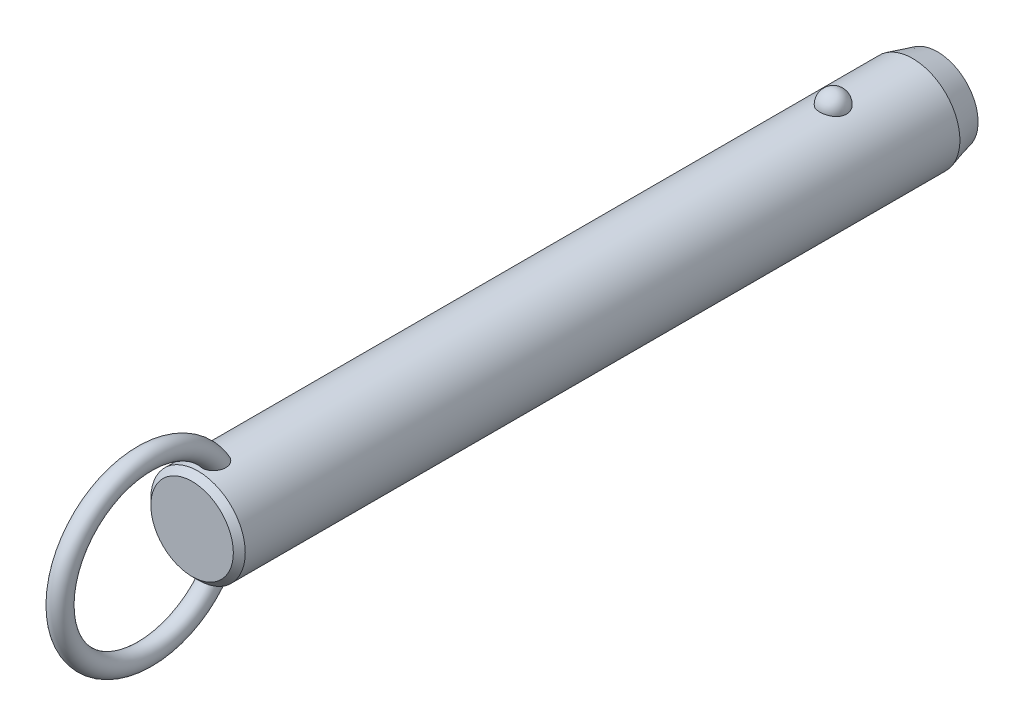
ISO-10303-21;
HEADER;
FILE_DESCRIPTION(('STEP AP214'),'2;1');
FILE_NAME('part.step','',(''),(''),'','','');
FILE_SCHEMA(('AUTOMOTIVE_DESIGN { 1 0 10303 214 1 1 1 1 }'));
ENDSEC;
DATA;
#1=APPLICATION_CONTEXT('core data for automotive mechanical design processes');
#2=APPLICATION_PROTOCOL_DEFINITION('international standard','automotive_design',2000,#1);
#3=PRODUCT_CONTEXT('',#1,'mechanical');
#4=PRODUCT('Part','Part','',(#3));
#5=PRODUCT_RELATED_PRODUCT_CATEGORY('part','',(#4));
#6=PRODUCT_DEFINITION_FORMATION('','',#4);
#7=PRODUCT_DEFINITION_CONTEXT('part definition',#1,'design');
#8=PRODUCT_DEFINITION('design','',#6,#7);
#9=PRODUCT_DEFINITION_SHAPE('','',#8);
#10=(LENGTH_UNIT() NAMED_UNIT(*) SI_UNIT(.MILLI.,.METRE.));
#11=(NAMED_UNIT(*) PLANE_ANGLE_UNIT() SI_UNIT($,.RADIAN.));
#12=(NAMED_UNIT(*) SI_UNIT($,.STERADIAN.) SOLID_ANGLE_UNIT());
#13=UNCERTAINTY_MEASURE_WITH_UNIT(LENGTH_MEASURE(1.E-05),#10,'distance_accuracy_value','');
#14=(GEOMETRIC_REPRESENTATION_CONTEXT(3) GLOBAL_UNCERTAINTY_ASSIGNED_CONTEXT((#13)) GLOBAL_UNIT_ASSIGNED_CONTEXT((#10,
#11,#12)) REPRESENTATION_CONTEXT('',''));
#15=CARTESIAN_POINT('',(0.,0.,0.));
#16=DIRECTION('',(0.,0.,1.));
#17=DIRECTION('',(1.,0.,0.));
#18=AXIS2_PLACEMENT_3D('',#15,#16,#17);
#19=CARTESIAN_POINT('',(0.,0.,116.8));
#20=DIRECTION('',(0.,0.,-1.));
#21=DIRECTION('',(-1.,0.,0.));
#22=AXIS2_PLACEMENT_3D('',#19,#20,#21);
#23=CYLINDRICAL_SURFACE('',#22,9.5);
#24=CARTESIAN_POINT('',(2.67259918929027,9.11631578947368,-2.70000000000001));
#25=CARTESIAN_POINT('',(2.6725968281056,9.11631786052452,-2.54909854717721));
#26=CARTESIAN_POINT('',(2.66030567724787,9.11994722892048,-2.39816735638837));
#27=CARTESIAN_POINT('',(2.6114347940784,9.13405924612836,-2.10058568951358));
#28=CARTESIAN_POINT('',(2.57484658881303,9.14454428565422,-1.95393672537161));
#29=CARTESIAN_POINT('',(2.47830875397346,9.17117631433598,-1.66916069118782));
#30=CARTESIAN_POINT('',(2.41836936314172,9.18732082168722,-1.53102991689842));
#31=CARTESIAN_POINT('',(2.27661331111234,9.22346780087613,-1.26705393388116));
#32=CARTESIAN_POINT('',(2.19479699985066,9.24347021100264,-1.14120852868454));
#33=CARTESIAN_POINT('',(2.01085282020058,9.28522401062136,-0.904632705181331));
#34=CARTESIAN_POINT('',(1.90862396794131,9.30698376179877,-0.793982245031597));
#35=CARTESIAN_POINT('',(1.6867437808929,9.34973971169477,-0.591607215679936));
#36=CARTESIAN_POINT('',(1.56709244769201,9.37073591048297,-0.499882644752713));
#37=CARTESIAN_POINT('',(1.31393976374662,9.40956370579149,-0.338167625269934));
#38=CARTESIAN_POINT('',(1.18048026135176,9.42740444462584,-0.268113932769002));
#39=CARTESIAN_POINT('',(0.903154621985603,9.45799906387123,-0.151390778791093));
#40=CARTESIAN_POINT('',(0.759289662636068,9.47075351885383,-0.104718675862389));
#41=CARTESIAN_POINT('',(0.468074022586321,9.48956256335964,-0.0367633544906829));
#42=CARTESIAN_POINT('',(0.320836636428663,9.49573643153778,-0.0150275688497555));
#43=CARTESIAN_POINT('',(0.0246714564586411,9.50112183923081,0.00396199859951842));
#44=CARTESIAN_POINT('',(-0.124256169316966,9.50033406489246,0.00121819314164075));
#45=CARTESIAN_POINT('',(-0.417264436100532,9.4919475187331,-0.0284441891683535));
#46=CARTESIAN_POINT('',(-0.56138413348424,9.48444885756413,-0.0550074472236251));
#47=CARTESIAN_POINT('',(-0.842986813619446,9.46357853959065,-0.131064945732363));
#48=CARTESIAN_POINT('',(-0.980469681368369,9.450206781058,-0.180559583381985));
#49=CARTESIAN_POINT('',(-1.24585005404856,9.41890822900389,-0.301476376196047));
#50=CARTESIAN_POINT('',(-1.37368611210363,9.40095498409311,-0.373026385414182));
#51=CARTESIAN_POINT('',(-1.61552738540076,9.36242964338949,-0.536025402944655));
#52=CARTESIAN_POINT('',(-1.72953116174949,9.34185727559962,-0.627476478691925));
#53=CARTESIAN_POINT('',(-1.9429225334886,9.29984568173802,-0.829844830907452));
#54=CARTESIAN_POINT('',(-2.04198021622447,9.27839736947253,-0.94110821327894));
#55=CARTESIAN_POINT('',(-2.22026460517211,9.23735994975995,-1.17883414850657));
#56=CARTESIAN_POINT('',(-2.29948985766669,9.21777097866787,-1.30529781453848));
#57=CARTESIAN_POINT('',(-2.43697287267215,9.18238994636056,-1.57158566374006));
#58=CARTESIAN_POINT('',(-2.49497068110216,9.16664569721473,-1.71155057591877));
#59=CARTESIAN_POINT('',(-2.5872073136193,9.14104303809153,-1.99961197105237));
#60=CARTESIAN_POINT('',(-2.62144683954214,9.13118445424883,-2.14770821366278));
#61=CARTESIAN_POINT('',(-2.66521466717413,9.11850622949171,-2.44715424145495));
#62=CARTESIAN_POINT('',(-2.67484831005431,9.11565658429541,-2.59848735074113));
#63=CARTESIAN_POINT('',(-2.66946735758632,9.11723375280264,-2.90067317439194));
#64=CARTESIAN_POINT('',(-2.65445345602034,9.12166036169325,-3.05152590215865));
#65=CARTESIAN_POINT('',(-2.60029711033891,9.13724422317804,-3.34766110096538));
#66=CARTESIAN_POINT('',(-2.56127978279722,9.14836656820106,-3.49296833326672));
#67=CARTESIAN_POINT('',(-2.46018844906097,9.17606676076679,-3.77477535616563));
#68=CARTESIAN_POINT('',(-2.39811349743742,9.1926448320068,-3.9112747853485));
#69=CARTESIAN_POINT('',(-2.25202303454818,9.22952198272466,-4.17244273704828));
#70=CARTESIAN_POINT('',(-2.16788714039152,9.24984129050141,-4.29704106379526));
#71=CARTESIAN_POINT('',(-1.9799408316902,9.29188255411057,-4.53013066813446));
#72=CARTESIAN_POINT('',(-1.87612963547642,9.31360456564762,-4.63862130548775));
#73=CARTESIAN_POINT('',(-1.65105429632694,9.35612959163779,-4.8369029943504));
#74=CARTESIAN_POINT('',(-1.52972405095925,9.37692871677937,-4.92661991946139));
#75=CARTESIAN_POINT('',(-1.27318250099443,9.41518970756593,-5.08429106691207));
#76=CARTESIAN_POINT('',(-1.13797219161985,9.432651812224,-5.15224684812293));
#77=CARTESIAN_POINT('',(-0.859280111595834,9.46208255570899,-5.26371827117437));
#78=CARTESIAN_POINT('',(-0.715925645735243,9.47411833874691,-5.30753421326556));
#79=CARTESIAN_POINT('',(-0.423550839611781,9.4916822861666,-5.37076321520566));
#80=CARTESIAN_POINT('',(-0.2745312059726,9.49721125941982,-5.39017930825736));
#81=CARTESIAN_POINT('',(0.0218446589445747,9.50110860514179,-5.40390587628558));
#82=CARTESIAN_POINT('',(0.16917707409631,9.49961381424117,-5.39869609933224));
#83=CARTESIAN_POINT('',(0.460808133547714,9.48993906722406,-5.36441955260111));
#84=CARTESIAN_POINT('',(0.605106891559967,9.48175936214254,-5.33535367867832));
#85=CARTESIAN_POINT('',(0.886027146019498,9.4596376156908,-5.25435587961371));
#86=CARTESIAN_POINT('',(1.02267710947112,9.44571881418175,-5.20251612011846));
#87=CARTESIAN_POINT('',(1.28523827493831,9.41358993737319,-5.07741549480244));
#88=CARTESIAN_POINT('',(1.41114877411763,9.39537958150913,-5.00415322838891));
#89=CARTESIAN_POINT('',(1.65085227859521,9.3562644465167,-4.83684599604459));
#90=CARTESIAN_POINT('',(1.76442346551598,9.33532178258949,-4.74249218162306));
#91=CARTESIAN_POINT('',(1.97425672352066,9.29321198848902,-4.53620389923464));
#92=CARTESIAN_POINT('',(2.07051582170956,9.27204482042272,-4.42426641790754));
#93=CARTESIAN_POINT('',(2.24490086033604,9.23139221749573,-4.18363183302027));
#94=CARTESIAN_POINT('',(2.32267019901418,9.21194380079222,-4.05466990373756));
#95=CARTESIAN_POINT('',(2.45584092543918,9.1773419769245,-3.78517836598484));
#96=CARTESIAN_POINT('',(2.5112497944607,9.16218713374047,-3.64465264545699));
#97=CARTESIAN_POINT('',(2.59380876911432,9.13913522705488,-3.37104301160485));
#98=CARTESIAN_POINT('',(2.62330266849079,9.13064624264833,-3.23871053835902));
#99=CARTESIAN_POINT('',(2.66269870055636,9.11923566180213,-2.97092664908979));
#100=CARTESIAN_POINT('',(2.67260130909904,9.11631393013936,-2.83547530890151));
#101=CARTESIAN_POINT('',(2.67259918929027,9.11631578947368,-2.70000000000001));
#102=B_SPLINE_CURVE_WITH_KNOTS('',3,(#24,#25,#26,#27,#28,#29,#30,#31,#32,#33,#34,#35,#36,#37,
#38,#39,#40,#41,#42,#43,#44,#45,#46,#47,#48,#49,#50,#51,#52,#53,#54,#55,#56,#57,#58,#59,#60,#61,
#62,#63,#64,#65,#66,#67,#68,#69,#70,#71,#72,#73,#74,#75,#76,#77,#78,#79,#80,#81,#82,#83,#84,#85,
#86,#87,#88,#89,#90,#91,#92,#93,#94,#95,#96,#97,#98,#99,#100,#101),.UNSPECIFIED.,.T.,.F.,(4,2,2,
2,2,2,2,2,2,2,2,2,2,2,2,2,2,2,2,2,2,2,2,2,2,2,2,2,2,2,2,2,2,2,2,2,2,2,4),(0.,0.452217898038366,
0.904593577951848,1.35677112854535,1.80894144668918,2.26340676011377,2.71787203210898,
3.17099820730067,3.62407318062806,4.0687883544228,4.51345969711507,4.95160616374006,
5.38976021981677,5.83050358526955,6.27129275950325,6.72071308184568,7.17016633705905,
7.62495278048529,8.07972578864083,8.53254856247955,8.98535859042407,9.43582813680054,
9.88631615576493,10.3393155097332,10.7923328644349,11.2471065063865,11.7018475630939,
12.150795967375,12.599688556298,13.0398725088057,13.4800399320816,13.9184421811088,
14.3568730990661,14.802202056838,15.2476074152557,15.7010097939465,16.1542603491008,
16.5602594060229,16.966248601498),.UNSPECIFIED.);
#103=CARTESIAN_POINT('',(2.67259918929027,9.11631578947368,-2.70000000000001));
#104=VERTEX_POINT('',#103);
#105=EDGE_CURVE('E41',#104,#104,#102,.T.);
#106=ORIENTED_EDGE('',*,*,#105,.T.);
#107=EDGE_LOOP('',(#106));
#108=FACE_BOUND('',#107,.T.);
#109=CARTESIAN_POINT('',(0.,0.,125.12));
#110=DIRECTION('',(0.,0.,1.));
#111=DIRECTION('',(1.,0.,0.));
#112=AXIS2_PLACEMENT_3D('',#109,#110,#111);
#113=CIRCLE('',#112,9.5);
#114=CARTESIAN_POINT('',(9.5,0.,125.12));
#115=VERTEX_POINT('',#114);
#116=EDGE_CURVE('E10',#115,#115,#113,.F.);
#117=ORIENTED_EDGE('',*,*,#116,.T.);
#118=EDGE_LOOP('',(#117));
#119=FACE_BOUND('',#118,.T.);
#120=CARTESIAN_POINT('',(-0.697062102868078,-9.47439269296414,119.467808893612));
#121=CARTESIAN_POINT('',(-0.799579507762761,-9.46685146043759,119.507482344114));
#122=CARTESIAN_POINT('',(-0.898575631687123,-9.45788043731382,119.5559309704));
#123=CARTESIAN_POINT('',(-1.08670047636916,-9.43811593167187,119.668868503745));
#124=CARTESIAN_POINT('',(-1.17583204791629,-9.42732297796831,119.733352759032));
#125=CARTESIAN_POINT('',(-1.34179806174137,-9.40513672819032,119.876209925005));
#126=CARTESIAN_POINT('',(-1.41865133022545,-9.39374438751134,119.954561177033));
#127=CARTESIAN_POINT('',(-1.55860047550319,-9.37154196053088,120.122752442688));
#128=CARTESIAN_POINT('',(-1.62169476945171,-9.3607319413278,120.21259377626));
#129=CARTESIAN_POINT('',(-1.73527695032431,-9.34035749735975,120.404500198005));
#130=CARTESIAN_POINT('',(-1.78522266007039,-9.33085270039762,120.506891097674));
#131=CARTESIAN_POINT('',(-1.86924997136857,-9.3143834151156,120.718148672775));
#132=CARTESIAN_POINT('',(-1.90332570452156,-9.30741986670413,120.827017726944));
#133=CARTESIAN_POINT('',(-1.95893603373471,-9.29588482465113,121.060473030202));
#134=CARTESIAN_POINT('',(-1.97872420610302,-9.29165182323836,121.185489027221));
#135=CARTESIAN_POINT('',(-2.00062129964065,-9.28695978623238,121.437080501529));
#136=CARTESIAN_POINT('',(-2.00272284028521,-9.28650232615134,121.563656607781));
#137=CARTESIAN_POINT('',(-1.98958876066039,-9.28932750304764,121.836815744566));
#138=CARTESIAN_POINT('',(-1.97143366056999,-9.2932400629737,121.983251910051));
#139=CARTESIAN_POINT('',(-1.91479925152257,-9.30507151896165,122.272062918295));
#140=CARTESIAN_POINT('',(-1.87629122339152,-9.31299607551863,122.414431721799));
#141=CARTESIAN_POINT('',(-1.7722568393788,-9.33340232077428,122.715172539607));
#142=CARTESIAN_POINT('',(-1.70334898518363,-9.34641636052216,122.872369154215));
#143=CARTESIAN_POINT('',(-1.58111062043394,-9.36759153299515,123.097517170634));
#144=CARTESIAN_POINT('',(-1.53721459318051,-9.37492619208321,123.170796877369));
#145=CARTESIAN_POINT('',(-1.4430263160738,-9.38988566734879,123.31307405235));
#146=CARTESIAN_POINT('',(-1.39273721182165,-9.39751033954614,123.382073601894));
#147=CARTESIAN_POINT('',(-1.26775962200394,-9.41530678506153,123.536983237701));
#148=CARTESIAN_POINT('',(-1.19052326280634,-9.42548108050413,123.620871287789));
#149=CARTESIAN_POINT('',(-1.0242024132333,-9.44499825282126,123.776008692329));
#150=CARTESIAN_POINT('',(-0.935139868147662,-9.45434261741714,123.847280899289));
#151=CARTESIAN_POINT('',(-0.766610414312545,-9.46930670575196,123.958695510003));
#152=CARTESIAN_POINT('',(-0.689439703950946,-9.47529223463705,124.002235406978));
#153=CARTESIAN_POINT('',(-0.528942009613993,-9.48560294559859,124.07631336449));
#154=CARTESIAN_POINT('',(-0.445620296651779,-9.48992953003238,124.106862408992));
#155=CARTESIAN_POINT('',(-0.273901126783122,-9.49644161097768,124.152579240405));
#156=CARTESIAN_POINT('',(-0.185465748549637,-9.49860811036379,124.16761059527));
#157=CARTESIAN_POINT('',(-0.00734541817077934,-9.5004135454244,124.180149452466));
#158=CARTESIAN_POINT('',(0.0823387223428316,-9.50005405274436,124.177667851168));
#159=CARTESIAN_POINT('',(0.247679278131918,-9.49708301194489,124.156995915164));
#160=CARTESIAN_POINT('',(0.32362017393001,-9.49477609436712,124.140930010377));
#161=CARTESIAN_POINT('',(0.47198153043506,-9.48855917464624,124.097172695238));
#162=CARTESIAN_POINT('',(0.54440029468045,-9.48464840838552,124.069475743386));
#163=CARTESIAN_POINT('',(0.708947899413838,-9.47398336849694,123.99280266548));
#164=CARTESIAN_POINT('',(0.799149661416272,-9.46671310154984,123.939774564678));
#165=CARTESIAN_POINT('',(0.969783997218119,-9.45076225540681,123.819973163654));
#166=CARTESIAN_POINT('',(1.05019415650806,-9.44207854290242,123.753169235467));
#167=CARTESIAN_POINT('',(1.23092343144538,-9.42051459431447,123.580759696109));
#168=CARTESIAN_POINT('',(1.32652499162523,-9.40733378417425,123.47026193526));
#169=CARTESIAN_POINT('',(1.49893121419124,-9.3814074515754,123.235561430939));
#170=CARTESIAN_POINT('',(1.57571616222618,-9.36866239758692,123.111344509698));
#171=CARTESIAN_POINT('',(1.71285426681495,-9.34457644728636,122.849389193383));
#172=CARTESIAN_POINT('',(1.7726636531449,-9.33328726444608,122.71136233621));
#173=CARTESIAN_POINT('',(1.87239208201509,-9.31379209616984,122.428051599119));
#174=CARTESIAN_POINT('',(1.91230158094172,-9.3055875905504,122.282764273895));
#175=CARTESIAN_POINT('',(1.97604189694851,-9.29228394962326,121.962028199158));
#176=CARTESIAN_POINT('',(1.99587438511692,-9.28797202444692,121.785724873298));
#177=CARTESIAN_POINT('',(2.0029570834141,-9.28645519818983,121.432414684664));
#178=CARTESIAN_POINT('',(1.99025930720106,-9.28923895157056,121.255409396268));
#179=CARTESIAN_POINT('',(1.93735479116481,-9.30038134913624,120.956338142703));
#180=CARTESIAN_POINT('',(1.90576827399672,-9.30697680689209,120.832667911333));
#181=CARTESIAN_POINT('',(1.82287484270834,-9.32356855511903,120.592329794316));
#182=CARTESIAN_POINT('',(1.77158213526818,-9.33356239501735,120.475656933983));
#183=CARTESIAN_POINT('',(1.64885744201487,-9.35602275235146,120.252706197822));
#184=CARTESIAN_POINT('',(1.57730995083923,-9.36850332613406,120.146492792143));
#185=CARTESIAN_POINT('',(1.41543264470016,-9.39431873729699,119.949553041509));
#186=CARTESIAN_POINT('',(1.3251088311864,-9.40765330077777,119.858821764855));
#187=CARTESIAN_POINT('',(1.13846223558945,-9.43195720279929,119.705033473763));
#188=CARTESIAN_POINT('',(1.04369890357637,-9.44302894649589,119.640094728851));
#189=CARTESIAN_POINT('',(0.84396568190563,-9.46296805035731,119.528038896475));
#190=CARTESIAN_POINT('',(0.73900000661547,-9.4718363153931,119.480914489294));
#191=CARTESIAN_POINT('',(0.528175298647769,-9.48586140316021,119.408117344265));
#192=CARTESIAN_POINT('',(0.422686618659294,-9.49119633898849,119.38140249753));
#193=CARTESIAN_POINT('',(0.208590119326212,-9.49831365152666,119.346013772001));
#194=CARTESIAN_POINT('',(0.0999817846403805,-9.500095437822,119.337342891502));
#195=CARTESIAN_POINT('',(-0.126104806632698,-9.49988861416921,119.338350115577));
#196=CARTESIAN_POINT('',(-0.243578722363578,-9.49757821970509,119.349594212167));
#197=CARTESIAN_POINT('',(-0.474390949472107,-9.48885165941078,119.393167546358));
#198=CARTESIAN_POINT('',(-0.587729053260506,-9.48243528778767,119.425497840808));
#199=CARTESIAN_POINT('',(-0.697062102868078,-9.47439269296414,119.467808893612));
#200=B_SPLINE_CURVE_WITH_KNOTS('',3,(#120,#121,#122,#123,#124,#125,#126,#127,#128,#129,#130,
#131,#132,#133,#134,#135,#136,#137,#138,#139,#140,#141,#142,#143,#144,#145,#146,#147,#148,#149,
#150,#151,#152,#153,#154,#155,#156,#157,#158,#159,#160,#161,#162,#163,#164,#165,#166,#167,#168,
#169,#170,#171,#172,#173,#174,#175,#176,#177,#178,#179,#180,#181,#182,#183,#184,#185,#186,#187,
#188,#189,#190,#191,#192,#193,#194,#195,#196,#197,#198,#199),.UNSPECIFIED.,.T.,.F.,(4,2,2,2,2,2,
2,2,2,2,2,2,2,2,2,2,2,2,2,2,2,2,2,2,2,2,2,2,2,2,2,2,2,2,2,2,2,2,2,4),(0.,0.330119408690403,
0.660143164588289,0.98965593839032,1.31920659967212,1.66074728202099,2.00241415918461,
2.3808869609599,2.7595176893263,3.20065679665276,3.64242004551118,4.15620996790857,
4.41314162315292,4.66994734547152,5.0122866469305,5.35399933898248,5.61943037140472,
5.88463652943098,6.15215502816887,6.41950709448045,6.6514439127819,6.88349136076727,
7.19641200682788,7.51003602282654,7.94779711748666,8.38601491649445,8.83699707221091,
9.28819530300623,9.81778662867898,10.3465317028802,10.7284172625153,11.1100280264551,
11.4938603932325,11.8775702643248,12.2220189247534,12.5663259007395,12.8915939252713,
13.2169159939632,13.5689650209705,13.9210316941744),.UNSPECIFIED.);
#201=CARTESIAN_POINT('',(-0.697062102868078,-9.47439269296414,119.467808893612));
#202=VERTEX_POINT('',#201);
#203=EDGE_CURVE('E60',#202,#202,#200,.T.);
#204=ORIENTED_EDGE('',*,*,#203,.T.);
#205=EDGE_LOOP('',(#204));
#206=FACE_BOUND('',#205,.T.);
#207=CARTESIAN_POINT('',(-0.697062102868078,9.47439269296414,119.467808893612));
#208=CARTESIAN_POINT('',(-0.597792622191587,9.48169483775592,119.42939564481));
#209=CARTESIAN_POINT('',(-0.495106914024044,9.48766580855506,119.399168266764));
#210=CARTESIAN_POINT('',(-0.285876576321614,9.49627648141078,119.356032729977));
#211=CARTESIAN_POINT('',(-0.179324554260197,9.49890941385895,119.343159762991));
#212=CARTESIAN_POINT('',(0.0344157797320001,9.50053798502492,119.335166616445));
#213=CARTESIAN_POINT('',(0.141603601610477,9.49953613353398,119.340034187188));
#214=CARTESIAN_POINT('',(0.353563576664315,9.49401038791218,119.367365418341));
#215=CARTESIAN_POINT('',(0.458336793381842,9.48948807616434,119.38982117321));
#216=CARTESIAN_POINT('',(0.66249373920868,9.4774236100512,119.451671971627));
#217=CARTESIAN_POINT('',(0.761881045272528,9.46988348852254,119.491055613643));
#218=CARTESIAN_POINT('',(0.952608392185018,9.45260382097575,119.585634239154));
#219=CARTESIAN_POINT('',(1.04394806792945,9.44286417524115,119.640829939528));
#220=CARTESIAN_POINT('',(1.21712767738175,9.4221176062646,119.766066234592));
#221=CARTESIAN_POINT('',(1.29885671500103,9.41109835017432,119.836257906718));
#222=CARTESIAN_POINT('',(1.4497897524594,9.38903310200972,119.988980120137));
#223=CARTESIAN_POINT('',(1.51899278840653,9.37798710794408,120.071511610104));
#224=CARTESIAN_POINT('',(1.64602857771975,9.35654375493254,120.249776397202));
#225=CARTESIAN_POINT('',(1.70333052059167,9.34618688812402,120.345891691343));
#226=CARTESIAN_POINT('',(1.80259341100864,9.32755128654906,120.545897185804));
#227=CARTESIAN_POINT('',(1.84454942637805,9.31927322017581,120.649789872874));
#228=CARTESIAN_POINT('',(1.91637039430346,9.30478365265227,120.872213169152));
#229=CARTESIAN_POINT('',(1.944805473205,9.29882552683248,120.991219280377));
#230=CARTESIAN_POINT('',(1.98449865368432,9.29043398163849,121.232143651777));
#231=CARTESIAN_POINT('',(1.99574908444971,9.28800213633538,121.354063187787));
#232=CARTESIAN_POINT('',(2.00275141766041,9.28649645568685,121.616932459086));
#233=CARTESIAN_POINT('',(1.99588238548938,9.28799035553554,121.757952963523));
#234=CARTESIAN_POINT('',(1.96270559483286,9.29505517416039,122.037621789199));
#235=CARTESIAN_POINT('',(1.93637872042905,9.30063010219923,122.176267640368));
#236=CARTESIAN_POINT('',(1.85949176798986,9.31633564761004,122.472561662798));
#237=CARTESIAN_POINT('',(1.80549792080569,9.3270926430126,122.629290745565));
#238=CARTESIAN_POINT('',(1.67376869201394,9.3516306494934,122.932284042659));
#239=CARTESIAN_POINT('',(1.5960318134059,9.36541185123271,123.078547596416));
#240=CARTESIAN_POINT('',(1.4360277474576,9.39110706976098,123.325813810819));
#241=CARTESIAN_POINT('',(1.35831795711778,9.40278656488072,123.429791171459));
#242=CARTESIAN_POINT('',(1.18774483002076,9.42585025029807,123.624534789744));
#243=CARTESIAN_POINT('',(1.09490932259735,9.43723493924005,123.715324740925));
#244=CARTESIAN_POINT('',(0.921110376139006,9.45552616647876,123.85620334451));
#245=CARTESIAN_POINT('',(0.843738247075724,9.46281058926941,123.910656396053));
#246=CARTESIAN_POINT('',(0.681245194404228,9.47589120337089,124.006711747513));
#247=CARTESIAN_POINT('',(0.596135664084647,9.48168953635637,124.048332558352));
#248=CARTESIAN_POINT('',(0.433779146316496,9.49038144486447,124.110089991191));
#249=CARTESIAN_POINT('',(0.35745955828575,9.49359170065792,124.13260136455));
#250=CARTESIAN_POINT('',(0.202074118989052,9.49816761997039,124.164574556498));
#251=CARTESIAN_POINT('',(0.123010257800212,9.49953459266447,124.174045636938));
#252=CARTESIAN_POINT('',(-0.035737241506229,9.50026497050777,124.179114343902));
#253=CARTESIAN_POINT('',(-0.115421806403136,9.49962433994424,124.174684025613));
#254=CARTESIAN_POINT('',(-0.272823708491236,9.49640854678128,124.152296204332));
#255=CARTESIAN_POINT('',(-0.350540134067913,9.4938325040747,124.134332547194));
#256=CARTESIAN_POINT('',(-0.500580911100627,9.4870946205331,124.086802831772));
#257=CARTESIAN_POINT('',(-0.572979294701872,9.48296359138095,124.057461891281));
#258=CARTESIAN_POINT('',(-0.712864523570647,9.47347609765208,123.989008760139));
#259=CARTESIAN_POINT('',(-0.780349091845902,9.46811906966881,123.949892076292));
#260=CARTESIAN_POINT('',(-0.946309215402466,9.45329720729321,123.839432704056));
#261=CARTESIAN_POINT('',(-1.04090230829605,9.44321512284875,123.762329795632));
#262=CARTESIAN_POINT('',(-1.21661929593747,9.42219227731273,123.59409718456));
#263=CARTESIAN_POINT('',(-1.29770519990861,9.41124921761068,123.502929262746));
#264=CARTESIAN_POINT('',(-1.4731964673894,9.38563439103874,123.276162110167));
#265=CARTESIAN_POINT('',(-1.56208878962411,9.37102009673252,123.136289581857));
#266=CARTESIAN_POINT('',(-1.71623987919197,9.34401559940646,122.843950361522));
#267=CARTESIAN_POINT('',(-1.78147866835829,9.33162728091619,122.691473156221));
#268=CARTESIAN_POINT('',(-1.88853837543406,9.31055541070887,122.375647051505));
#269=CARTESIAN_POINT('',(-1.92998995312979,9.30193076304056,122.212168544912));
#270=CARTESIAN_POINT('',(-1.98590726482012,9.29015757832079,121.880526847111));
#271=CARTESIAN_POINT('',(-2.00040705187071,9.2870021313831,121.712369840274));
#272=CARTESIAN_POINT('',(-1.99964701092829,9.28716218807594,121.405080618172));
#273=CARTESIAN_POINT('',(-1.98908145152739,9.28945704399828,121.265936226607));
#274=CARTESIAN_POINT('',(-1.94566294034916,9.29865169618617,120.991153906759));
#275=CARTESIAN_POINT('',(-1.91282062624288,9.30554929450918,120.855514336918));
#276=CARTESIAN_POINT('',(-1.84582133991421,9.31898248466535,120.657802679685));
#277=CARTESIAN_POINT('',(-1.82038084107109,9.32400364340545,120.592583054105));
#278=CARTESIAN_POINT('',(-1.76350511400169,9.33492884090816,120.464903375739));
#279=CARTESIAN_POINT('',(-1.73207305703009,9.3408324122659,120.402441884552));
#280=CARTESIAN_POINT('',(-1.66324243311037,9.353333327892,120.28094078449));
#281=CARTESIAN_POINT('',(-1.62584239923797,9.35993084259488,120.221902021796));
#282=CARTESIAN_POINT('',(-1.545276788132,9.37356864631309,120.107987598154));
#283=CARTESIAN_POINT('',(-1.50211241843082,9.38060884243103,120.053111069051));
#284=CARTESIAN_POINT('',(-1.37681147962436,9.40004442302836,119.909961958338));
#285=CARTESIAN_POINT('',(-1.28916358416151,9.41261047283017,119.826429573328));
#286=CARTESIAN_POINT('',(-1.09996826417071,9.43658180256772,119.677236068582));
#287=CARTESIAN_POINT('',(-0.998461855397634,9.44799034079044,119.611523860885));
#288=CARTESIAN_POINT('',(-0.860188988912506,9.46103017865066,119.5394367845));
#289=CARTESIAN_POINT('',(-0.828141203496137,9.46389141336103,119.523851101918));
#290=CARTESIAN_POINT('',(-0.763210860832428,9.46934915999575,119.494473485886));
#291=CARTESIAN_POINT('',(-0.730328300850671,9.47194567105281,119.480681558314));
#292=CARTESIAN_POINT('',(-0.697062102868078,9.47439269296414,119.467808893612));
#293=B_SPLINE_CURVE_WITH_KNOTS('',3,(#207,#208,#209,#210,#211,#212,#213,#214,#215,#216,#217,
#218,#219,#220,#221,#222,#223,#224,#225,#226,#227,#228,#229,#230,#231,#232,#233,#234,#235,#236,
#237,#238,#239,#240,#241,#242,#243,#244,#245,#246,#247,#248,#249,#250,#251,#252,#253,#254,#255,
#256,#257,#258,#259,#260,#261,#262,#263,#264,#265,#266,#267,#268,#269,#270,#271,#272,#273,#274,
#275,#276,#277,#278,#279,#280,#281,#282,#283,#284,#285,#286,#287,#288,#289,#290,#291,#292),
.UNSPECIFIED.,.T.,.F.,(4,2,2,2,2,2,2,2,2,2,2,2,2,2,2,2,2,2,2,2,2,2,2,2,2,2,2,2,2,2,2,2,2,2,2,2,
2,2,2,2,2,2,4),(0.,0.319942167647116,0.640532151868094,0.96090081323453,1.28112555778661,
1.60113495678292,1.92115886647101,2.24457323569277,2.56801248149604,2.90371927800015,
3.23953387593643,3.60560313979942,3.97183576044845,4.39383693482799,4.81625324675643,
5.31257045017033,5.80891895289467,6.19868344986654,6.58773876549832,6.87145417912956,
7.15475838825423,7.3926375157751,7.63034760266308,7.8685358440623,8.10683246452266,
8.34063661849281,8.57454843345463,8.93983939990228,9.30614105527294,9.80266668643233,
10.2996107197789,10.8040753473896,11.3079021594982,11.7249776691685,12.1418541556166,
12.3521485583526,12.562331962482,12.7725671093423,12.9827582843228,13.3458276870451,
13.7078449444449,13.8150604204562,13.9222762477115),.UNSPECIFIED.);
#294=CARTESIAN_POINT('',(-0.697062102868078,9.47439269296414,119.467808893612));
#295=VERTEX_POINT('',#294);
#296=EDGE_CURVE('E68',#295,#295,#293,.T.);
#297=ORIENTED_EDGE('',*,*,#296,.T.);
#298=EDGE_LOOP('',(#297));
#299=FACE_BOUND('',#298,.T.);
#300=CARTESIAN_POINT('',(0.,0.,-18.6999999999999));
#301=DIRECTION('',(0.,0.,-1.));
#302=DIRECTION('',(-1.,0.,0.));
#303=AXIS2_PLACEMENT_3D('',#300,#301,#302);
#304=CIRCLE('',#303,9.5);
#305=CARTESIAN_POINT('',(-9.5,0.,-18.6999999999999));
#306=VERTEX_POINT('',#305);
#307=EDGE_CURVE('E57',#306,#306,#304,.F.);
#308=ORIENTED_EDGE('',*,*,#307,.T.);
#309=EDGE_LOOP('',(#308));
#310=FACE_BOUND('',#309,.T.);
#311=ADVANCED_FACE('F37',(#108,#119,#206,#299,#310),#23,.T.);
#312=CARTESIAN_POINT('',(0.,0.,-23.7));
#313=DIRECTION('',(0.,0.,-1.));
#314=DIRECTION('',(-1.,0.,0.));
#315=AXIS2_PLACEMENT_3D('',#312,#313,#314);
#316=PLANE('',#315);
#317=CARTESIAN_POINT('',(0.,0.,-23.7));
#318=DIRECTION('',(0.,0.,-1.));
#319=DIRECTION('',(-1.,0.,0.));
#320=AXIS2_PLACEMENT_3D('',#317,#318,#319);
#321=CIRCLE('',#320,8.16025403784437);
#322=CARTESIAN_POINT('',(-8.16025403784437,0.,-23.7));
#323=VERTEX_POINT('',#322);
#324=EDGE_CURVE('E67',#323,#323,#321,.T.);
#325=ORIENTED_EDGE('',*,*,#324,.T.);
#326=EDGE_LOOP('',(#325));
#327=FACE_BOUND('',#326,.T.);
#328=ADVANCED_FACE('F86',(#327),#316,.T.);
#329=CARTESIAN_POINT('',(0.,0.,-23.7));
#330=DIRECTION('',(0.,0.,1.));
#331=DIRECTION('',(1.,0.,0.));
#332=AXIS2_PLACEMENT_3D('',#329,#330,#331);
#333=CONICAL_SURFACE('',#332,8.16025403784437,0.261799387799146);
#334=ORIENTED_EDGE('',*,*,#307,.F.);
#335=EDGE_LOOP('',(#334));
#336=FACE_BOUND('',#335,.T.);
#337=ORIENTED_EDGE('',*,*,#324,.F.);
#338=EDGE_LOOP('',(#337));
#339=FACE_BOUND('',#338,.T.);
#340=ADVANCED_FACE('F84',(#336,#339),#333,.T.);
#341=CARTESIAN_POINT('',(0.,0.,126.32));
#342=DIRECTION('',(0.,0.,1.));
#343=DIRECTION('',(1.,0.,0.));
#344=AXIS2_PLACEMENT_3D('',#341,#342,#343);
#345=PLANE('',#344);
#346=CARTESIAN_POINT('',(0.,0.,126.32));
#347=DIRECTION('',(0.,0.,1.));
#348=DIRECTION('',(1.,0.,0.));
#349=AXIS2_PLACEMENT_3D('',#346,#347,#348);
#350=CIRCLE('',#349,8.30000000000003);
#351=CARTESIAN_POINT('',(8.30000000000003,0.,126.32));
#352=VERTEX_POINT('',#351);
#353=EDGE_CURVE('E50',#352,#352,#350,.T.);
#354=ORIENTED_EDGE('',*,*,#353,.T.);
#355=EDGE_LOOP('',(#354));
#356=FACE_BOUND('',#355,.T.);
#357=ADVANCED_FACE('F78',(#356),#345,.T.);
#358=CARTESIAN_POINT('',(0.,0.,135.85));
#359=DIRECTION('',(1.,0.,0.));
#360=DIRECTION('',(0.,0.,-1.));
#361=AXIS2_PLACEMENT_3D('',#358,#359,#360);
#362=TOROIDAL_SURFACE('',#361,17.05,2.);
#363=ORIENTED_EDGE('',*,*,#296,.F.);
#364=EDGE_LOOP('',(#363));
#365=FACE_BOUND('',#364,.T.);
#366=ORIENTED_EDGE('',*,*,#203,.F.);
#367=EDGE_LOOP('',(#366));
#368=FACE_BOUND('',#367,.T.);
#369=ADVANCED_FACE('F74',(#365,#368),#362,.T.);
#370=CARTESIAN_POINT('',(0.,0.,126.32));
#371=DIRECTION('',(0.,0.,-1.));
#372=DIRECTION('',(-1.,0.,0.));
#373=AXIS2_PLACEMENT_3D('',#370,#371,#372);
#374=CONICAL_SURFACE('',#373,8.30000000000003,0.785398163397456);
#375=ORIENTED_EDGE('',*,*,#116,.F.);
#376=EDGE_LOOP('',(#375));
#377=FACE_BOUND('',#376,.T.);
#378=ORIENTED_EDGE('',*,*,#353,.F.);
#379=EDGE_LOOP('',(#378));
#380=FACE_BOUND('',#379,.T.);
#381=ADVANCED_FACE('F39',(#377,#380),#374,.T.);
#382=CARTESIAN_POINT('',(0.,9.5,-2.70000000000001));
#383=DIRECTION('',(0.,1.,0.));
#384=DIRECTION('',(0.,0.,-1.));
#385=AXIS2_PLACEMENT_3D('',#382,#383,#384);
#386=SPHERICAL_SURFACE('',#385,2.7);
#387=ORIENTED_EDGE('',*,*,#105,.F.);
#388=EDGE_LOOP('',(#387));
#389=FACE_BOUND('',#388,.T.);
#390=ADVANCED_FACE('F80',(#389),#386,.T.);
#391=CLOSED_SHELL('',(#311,#328,#340,#357,#369,#381,#390));
#392=MANIFOLD_SOLID_BREP('B2',#391);
#393=ADVANCED_BREP_SHAPE_REPRESENTATION('',(#18,#392),#14);
#394=SHAPE_DEFINITION_REPRESENTATION(#9,#393);
ENDSEC;
END-ISO-10303-21;
